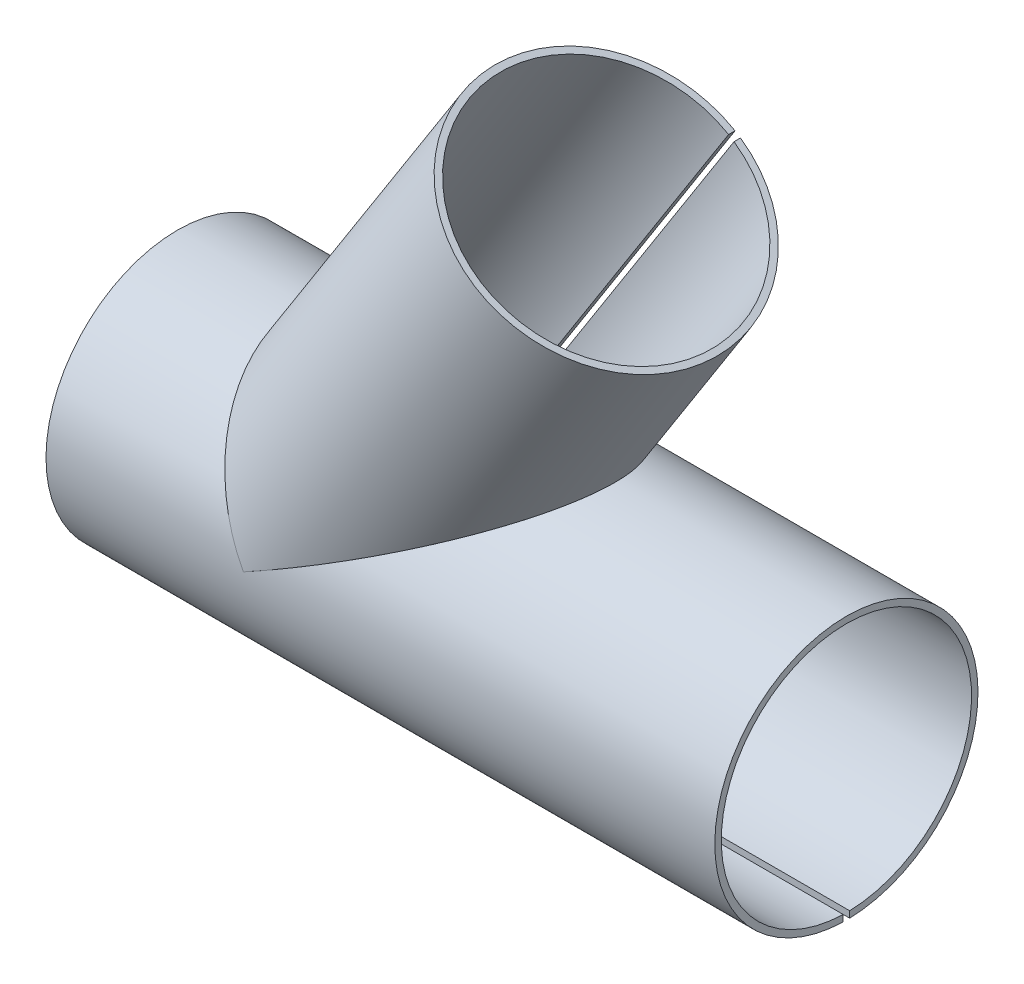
ISO-10303-21;
HEADER;
FILE_DESCRIPTION(('STEP AP214'),'2;1');
FILE_NAME('part.step','',(''),(''),'','','');
FILE_SCHEMA(('AUTOMOTIVE_DESIGN { 1 0 10303 214 1 1 1 1 }'));
ENDSEC;
DATA;
#1=APPLICATION_CONTEXT('core data for automotive mechanical design processes');
#2=APPLICATION_PROTOCOL_DEFINITION('international standard','automotive_design',2000,#1);
#3=PRODUCT_CONTEXT('',#1,'mechanical');
#4=PRODUCT('Part','Part','',(#3));
#5=PRODUCT_RELATED_PRODUCT_CATEGORY('part','',(#4));
#6=PRODUCT_DEFINITION_FORMATION('','',#4);
#7=PRODUCT_DEFINITION_CONTEXT('part definition',#1,'design');
#8=PRODUCT_DEFINITION('design','',#6,#7);
#9=PRODUCT_DEFINITION_SHAPE('','',#8);
#10=(LENGTH_UNIT() NAMED_UNIT(*) SI_UNIT(.MILLI.,.METRE.));
#11=(NAMED_UNIT(*) PLANE_ANGLE_UNIT() SI_UNIT($,.RADIAN.));
#12=(NAMED_UNIT(*) SI_UNIT($,.STERADIAN.) SOLID_ANGLE_UNIT());
#13=UNCERTAINTY_MEASURE_WITH_UNIT(LENGTH_MEASURE(1.E-05),#10,'distance_accuracy_value','');
#14=(GEOMETRIC_REPRESENTATION_CONTEXT(3) GLOBAL_UNCERTAINTY_ASSIGNED_CONTEXT((#13)) GLOBAL_UNIT_ASSIGNED_CONTEXT((#10,
#11,#12)) REPRESENTATION_CONTEXT('',''));
#15=CARTESIAN_POINT('',(0.,0.,0.));
#16=DIRECTION('',(0.,0.,1.));
#17=DIRECTION('',(1.,0.,0.));
#18=AXIS2_PLACEMENT_3D('',#15,#16,#17);
#19=CARTESIAN_POINT('',(0.,0.,0.));
#20=DIRECTION('',(0.537393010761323,0.843331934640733,0.));
#21=DIRECTION('',(-0.843331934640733,0.537393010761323,0.));
#22=AXIS2_PLACEMENT_3D('',#19,#20,#21);
#23=CYLINDRICAL_SURFACE('',#22,20.3683522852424);
#24=DIRECTION('',(0.537393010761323,0.843331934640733,0.));
#25=VECTOR('',#24,1.);
#26=CARTESIAN_POINT('',(0.421665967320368,-0.268696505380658,-20.362214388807));
#27=LINE('',#26,#25);
#28=CARTESIAN_POINT('',(36.2200673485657,55.9098069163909,-20.362214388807));
#29=VERTEX_POINT('',#28);
#30=CARTESIAN_POINT('',(0.911499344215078,0.499999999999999,-20.362214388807));
#31=VERTEX_POINT('',#30);
#32=EDGE_CURVE('E73',#29,#31,#27,.F.);
#33=ORIENTED_EDGE('',*,*,#32,.F.);
#34=CARTESIAN_POINT('',(35.7984013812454,56.1785034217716,0.));
#35=DIRECTION('',(0.537393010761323,0.843331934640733,0.));
#36=DIRECTION('',(-0.843331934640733,0.537393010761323,0.));
#37=AXIS2_PLACEMENT_3D('',#34,#35,#36);
#38=CIRCLE('',#37,20.3683522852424);
#39=CARTESIAN_POINT('',(35.376735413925,56.4471999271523,-20.362214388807));
#40=VERTEX_POINT('',#39);
#41=EDGE_CURVE('E117',#40,#29,#38,.T.);
#42=ORIENTED_EDGE('',*,*,#41,.F.);
#43=DIRECTION('',(0.537393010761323,0.843331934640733,0.));
#44=VECTOR('',#43,1.);
#45=CARTESIAN_POINT('',(-0.421665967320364,0.268696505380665,-20.362214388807));
#46=LINE('',#45,#44);
#47=CARTESIAN_POINT('',(-0.274273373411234,0.499999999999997,-20.362214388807));
#48=VERTEX_POINT('',#47);
#49=EDGE_CURVE('E103',#40,#48,#46,.F.);
#50=ORIENTED_EDGE('',*,*,#49,.T.);
#51=CARTESIAN_POINT('',(0.,0.,0.));
#52=DIRECTION('',(-0.876753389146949,-0.480940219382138,0.));
#53=DIRECTION('',(-0.480940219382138,0.876753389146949,0.));
#54=AXIS2_PLACEMENT_3D('',#51,#52,#53);
#55=ELLIPSE('',#54,23.2315637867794,20.3683522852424);
#56=CARTESIAN_POINT('',(0.,0.,20.3683522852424));
#57=VERTEX_POINT('',#56);
#58=EDGE_CURVE('E137',#48,#57,#55,.F.);
#59=ORIENTED_EDGE('',*,*,#58,.T.);
#60=CARTESIAN_POINT('',(0.,0.,0.));
#61=DIRECTION('',(0.480940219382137,-0.876753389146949,0.));
#62=DIRECTION('',(0.876753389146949,0.480940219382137,0.));
#63=AXIS2_PLACEMENT_3D('',#60,#61,#62);
#64=ELLIPSE('',#63,42.3511103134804,20.3683522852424);
#65=EDGE_CURVE('E127',#57,#31,#64,.F.);
#66=ORIENTED_EDGE('',*,*,#65,.T.);
#67=EDGE_LOOP('',(#33,#42,#50,#59,#66));
#68=FACE_BOUND('',#67,.T.);
#69=ADVANCED_FACE('F60',(#68),#23,.T.);
#70=CARTESIAN_POINT('',(-11.1729933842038,20.3683522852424,-20.3683522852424));
#71=DIRECTION('',(-0.876753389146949,-0.480940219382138,0.));
#72=DIRECTION('',(0.480940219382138,-0.876753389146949,0.));
#73=AXIS2_PLACEMENT_3D('',#70,#71,#72);
#74=PLANE('',#73);
#75=ORIENTED_EDGE('',*,*,#58,.F.);
#76=DIRECTION('',(0.,0.,1.));
#77=VECTOR('',#76,1.);
#78=CARTESIAN_POINT('',(-0.274273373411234,0.499999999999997,-20.3683522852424));
#79=LINE('',#78,#77);
#80=CARTESIAN_POINT('',(-0.274273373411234,0.499999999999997,-19.3618973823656));
#81=VERTEX_POINT('',#80);
#82=EDGE_CURVE('E67',#48,#81,#79,.T.);
#83=ORIENTED_EDGE('',*,*,#82,.T.);
#84=CARTESIAN_POINT('',(0.,0.,0.));
#85=DIRECTION('',(-0.876753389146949,-0.480940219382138,0.));
#86=DIRECTION('',(-0.480940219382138,0.876753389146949,0.));
#87=AXIS2_PLACEMENT_3D('',#84,#85,#86);
#88=ELLIPSE('',#87,22.0909922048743,19.3683522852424);
#89=CARTESIAN_POINT('',(0.,0.,19.3683522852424));
#90=VERTEX_POINT('',#89);
#91=EDGE_CURVE('E123',#81,#90,#88,.F.);
#92=ORIENTED_EDGE('',*,*,#91,.T.);
#93=DIRECTION('',(0.,0.,1.));
#94=VECTOR('',#93,1.);
#95=CARTESIAN_POINT('',(0.,0.,-20.3683522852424));
#96=LINE('',#95,#94);
#97=EDGE_CURVE('E145',#90,#57,#96,.T.);
#98=ORIENTED_EDGE('',*,*,#97,.T.);
#99=EDGE_LOOP('',(#75,#83,#92,#98));
#100=FACE_BOUND('',#99,.T.);
#101=ADVANCED_FACE('F134',(#100),#74,.T.);
#102=CARTESIAN_POINT('',(0.,0.,0.));
#103=DIRECTION('',(0.537393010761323,0.843331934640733,0.));
#104=DIRECTION('',(-0.843331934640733,0.537393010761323,0.));
#105=AXIS2_PLACEMENT_3D('',#102,#103,#104);
#106=CYLINDRICAL_SURFACE('',#105,19.3683522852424);
#107=CARTESIAN_POINT('',(35.7984013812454,56.1785034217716,0.));
#108=DIRECTION('',(0.537393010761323,0.843331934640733,0.));
#109=DIRECTION('',(-0.843331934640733,0.537393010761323,0.));
#110=AXIS2_PLACEMENT_3D('',#107,#108,#109);
#111=CIRCLE('',#110,19.3683522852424);
#112=CARTESIAN_POINT('',(35.376735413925,56.4471999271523,-19.3618973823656));
#113=VERTEX_POINT('',#112);
#114=CARTESIAN_POINT('',(36.2200673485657,55.9098069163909,-19.3618973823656));
#115=VERTEX_POINT('',#114);
#116=EDGE_CURVE('E119',#113,#115,#111,.T.);
#117=ORIENTED_EDGE('',*,*,#116,.T.);
#118=DIRECTION('',(0.537393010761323,0.843331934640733,0.));
#119=VECTOR('',#118,1.);
#120=CARTESIAN_POINT('',(0.421665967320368,-0.268696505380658,-19.3618973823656));
#121=LINE('',#120,#119);
#122=CARTESIAN_POINT('',(0.911499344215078,0.499999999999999,-19.3618973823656));
#123=VERTEX_POINT('',#122);
#124=EDGE_CURVE('E110',#115,#123,#121,.F.);
#125=ORIENTED_EDGE('',*,*,#124,.T.);
#126=CARTESIAN_POINT('',(0.,0.,0.));
#127=DIRECTION('',(0.480940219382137,-0.876753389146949,0.));
#128=DIRECTION('',(0.876753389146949,0.480940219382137,0.));
#129=AXIS2_PLACEMENT_3D('',#126,#127,#128);
#130=ELLIPSE('',#129,40.2718498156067,19.3683522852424);
#131=EDGE_CURVE('E125',#90,#123,#130,.F.);
#132=ORIENTED_EDGE('',*,*,#131,.F.);
#133=ORIENTED_EDGE('',*,*,#91,.F.);
#134=DIRECTION('',(0.537393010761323,0.843331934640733,0.));
#135=VECTOR('',#134,1.);
#136=CARTESIAN_POINT('',(-0.421665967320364,0.268696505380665,-19.3618973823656));
#137=LINE('',#136,#135);
#138=EDGE_CURVE('E81',#113,#81,#137,.F.);
#139=ORIENTED_EDGE('',*,*,#138,.F.);
#140=EDGE_LOOP('',(#117,#125,#132,#133,#139));
#141=FACE_BOUND('',#140,.T.);
#142=ADVANCED_FACE('F140',(#141),#106,.F.);
#143=CARTESIAN_POINT('',(35.7984013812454,56.1785034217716,0.));
#144=DIRECTION('',(0.537393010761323,0.843331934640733,0.));
#145=DIRECTION('',(-0.843331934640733,0.537393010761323,0.));
#146=AXIS2_PLACEMENT_3D('',#143,#144,#145);
#147=PLANE('',#146);
#148=DIRECTION('',(0.,0.,1.));
#149=VECTOR('',#148,1.);
#150=CARTESIAN_POINT('',(36.2200673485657,55.9098069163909,-20.3683522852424));
#151=LINE('',#150,#149);
#152=EDGE_CURVE('E120',#29,#115,#151,.T.);
#153=ORIENTED_EDGE('',*,*,#152,.T.);
#154=ORIENTED_EDGE('',*,*,#116,.F.);
#155=DIRECTION('',(0.,0.,1.));
#156=VECTOR('',#155,1.);
#157=CARTESIAN_POINT('',(35.376735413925,56.4471999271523,-20.3683522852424));
#158=LINE('',#157,#156);
#159=EDGE_CURVE('E106',#40,#113,#158,.T.);
#160=ORIENTED_EDGE('',*,*,#159,.F.);
#161=ORIENTED_EDGE('',*,*,#41,.T.);
#162=EDGE_LOOP('',(#153,#154,#160,#161));
#163=FACE_BOUND('',#162,.T.);
#164=ADVANCED_FACE('F116',(#163),#147,.T.);
#165=CARTESIAN_POINT('',(0.,0.,-20.3683522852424));
#166=DIRECTION('',(0.480940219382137,-0.876753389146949,0.));
#167=DIRECTION('',(0.876753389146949,0.480940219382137,0.));
#168=AXIS2_PLACEMENT_3D('',#165,#166,#167);
#169=PLANE('',#168);
#170=DIRECTION('',(0.,0.,1.));
#171=VECTOR('',#170,1.);
#172=CARTESIAN_POINT('',(0.911499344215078,0.499999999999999,-20.3683522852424));
#173=LINE('',#172,#171);
#174=EDGE_CURVE('E14',#31,#123,#173,.T.);
#175=ORIENTED_EDGE('',*,*,#174,.F.);
#176=ORIENTED_EDGE('',*,*,#65,.F.);
#177=ORIENTED_EDGE('',*,*,#97,.F.);
#178=ORIENTED_EDGE('',*,*,#131,.T.);
#179=EDGE_LOOP('',(#175,#176,#177,#178));
#180=FACE_BOUND('',#179,.T.);
#181=ADVANCED_FACE('F143',(#180),#169,.T.);
#182=CARTESIAN_POINT('',(-0.421665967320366,0.268696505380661,-20.3683522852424));
#183=DIRECTION('',(0.843331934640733,-0.537393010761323,0.));
#184=DIRECTION('',(0.537393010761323,0.843331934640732,0.));
#185=AXIS2_PLACEMENT_3D('',#182,#183,#184);
#186=PLANE('',#185);
#187=ORIENTED_EDGE('',*,*,#159,.T.);
#188=ORIENTED_EDGE('',*,*,#138,.T.);
#189=ORIENTED_EDGE('',*,*,#82,.F.);
#190=ORIENTED_EDGE('',*,*,#49,.F.);
#191=EDGE_LOOP('',(#187,#188,#189,#190));
#192=FACE_BOUND('',#191,.T.);
#193=ADVANCED_FACE('F105',(#192),#186,.T.);
#194=CARTESIAN_POINT('',(0.421665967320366,-0.268696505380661,-20.3683522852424));
#195=DIRECTION('',(0.843331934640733,-0.537393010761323,0.));
#196=DIRECTION('',(0.537393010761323,0.843331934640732,0.));
#197=AXIS2_PLACEMENT_3D('',#194,#195,#196);
#198=PLANE('',#197);
#199=ORIENTED_EDGE('',*,*,#32,.T.);
#200=ORIENTED_EDGE('',*,*,#174,.T.);
#201=ORIENTED_EDGE('',*,*,#124,.F.);
#202=ORIENTED_EDGE('',*,*,#152,.F.);
#203=EDGE_LOOP('',(#199,#200,#201,#202));
#204=FACE_BOUND('',#203,.T.);
#205=ADVANCED_FACE('F152',(#204),#198,.F.);
#206=CLOSED_SHELL('',(#69,#101,#142,#164,#181,#193,#205));
#207=MANIFOLD_SOLID_BREP('B2',#206);
#208=CARTESIAN_POINT('',(72.972061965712,0.,0.));
#209=DIRECTION('',(-1.,0.,0.));
#210=DIRECTION('',(0.,0.,1.));
#211=AXIS2_PLACEMENT_3D('',#208,#209,#210);
#212=CYLINDRICAL_SURFACE('',#211,20.3683522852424);
#213=CARTESIAN_POINT('',(0.,0.,0.));
#214=DIRECTION('',(-0.876753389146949,-0.480940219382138,0.));
#215=DIRECTION('',(-0.480940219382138,0.876753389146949,0.));
#216=AXIS2_PLACEMENT_3D('',#213,#214,#215);
#217=ELLIPSE('',#216,23.2315637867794,20.3683522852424);
#218=CARTESIAN_POINT('',(0.,0.,20.3683522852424));
#219=VERTEX_POINT('',#218);
#220=CARTESIAN_POINT('',(0.,0.,-20.3683522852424));
#221=VERTEX_POINT('',#220);
#222=EDGE_CURVE('E303',#219,#221,#217,.T.);
#223=ORIENTED_EDGE('',*,*,#222,.T.);
#224=CARTESIAN_POINT('',(0.,0.,0.));
#225=DIRECTION('',(0.480940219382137,-0.876753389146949,0.));
#226=DIRECTION('',(-0.876753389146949,-0.480940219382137,0.));
#227=AXIS2_PLACEMENT_3D('',#224,#225,#226);
#228=ELLIPSE('',#227,42.3511103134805,20.3683522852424);
#229=EDGE_CURVE('E309',#221,#219,#228,.T.);
#230=ORIENTED_EDGE('',*,*,#229,.T.);
#231=EDGE_LOOP('',(#223,#230));
#232=FACE_BOUND('',#231,.T.);
#233=CARTESIAN_POINT('',(-30.541636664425,0.,0.));
#234=DIRECTION('',(1.,0.,0.));
#235=DIRECTION('',(0.,0.,-1.));
#236=AXIS2_PLACEMENT_3D('',#233,#234,#235);
#237=CIRCLE('',#236,20.3683522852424);
#238=CARTESIAN_POINT('',(-30.541636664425,-20.362214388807,-0.5));
#239=VERTEX_POINT('',#238);
#240=CARTESIAN_POINT('',(-30.541636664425,-20.362214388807,0.5));
#241=VERTEX_POINT('',#240);
#242=EDGE_CURVE('E283',#239,#241,#237,.T.);
#243=ORIENTED_EDGE('',*,*,#242,.T.);
#244=DIRECTION('',(-1.,0.,0.));
#245=VECTOR('',#244,1.);
#246=CARTESIAN_POINT('',(72.972061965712,-20.362214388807,0.5));
#247=LINE('',#246,#245);
#248=CARTESIAN_POINT('',(72.972061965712,-20.362214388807,0.5));
#249=VERTEX_POINT('',#248);
#250=EDGE_CURVE('E224',#241,#249,#247,.F.);
#251=ORIENTED_EDGE('',*,*,#250,.T.);
#252=CARTESIAN_POINT('',(72.972061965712,0.,0.));
#253=DIRECTION('',(1.,0.,0.));
#254=DIRECTION('',(0.,0.,-1.));
#255=AXIS2_PLACEMENT_3D('',#252,#253,#254);
#256=CIRCLE('',#255,20.3683522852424);
#257=CARTESIAN_POINT('',(72.972061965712,-20.362214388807,-0.5));
#258=VERTEX_POINT('',#257);
#259=EDGE_CURVE('E274',#258,#249,#256,.T.);
#260=ORIENTED_EDGE('',*,*,#259,.F.);
#261=DIRECTION('',(-1.,0.,0.));
#262=VECTOR('',#261,1.);
#263=CARTESIAN_POINT('',(72.972061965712,-20.362214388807,-0.5));
#264=LINE('',#263,#262);
#265=EDGE_CURVE('E259',#239,#258,#264,.F.);
#266=ORIENTED_EDGE('',*,*,#265,.F.);
#267=EDGE_LOOP('',(#243,#251,#260,#266));
#268=FACE_BOUND('',#267,.T.);
#269=ADVANCED_FACE('F210',(#232,#268),#212,.T.);
#270=CARTESIAN_POINT('',(72.972061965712,0.,0.));
#271=DIRECTION('',(1.,0.,0.));
#272=DIRECTION('',(0.,0.,-1.));
#273=AXIS2_PLACEMENT_3D('',#270,#271,#272);
#274=PLANE('',#273);
#275=DIRECTION('',(0.,1.,0.));
#276=VECTOR('',#275,1.);
#277=CARTESIAN_POINT('',(72.972061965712,-20.3683522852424,0.5));
#278=LINE('',#277,#276);
#279=CARTESIAN_POINT('',(72.972061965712,-19.3618973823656,0.5));
#280=VERTEX_POINT('',#279);
#281=EDGE_CURVE('E277',#249,#280,#278,.T.);
#282=ORIENTED_EDGE('',*,*,#281,.T.);
#283=CARTESIAN_POINT('',(72.972061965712,0.,0.));
#284=DIRECTION('',(1.,0.,0.));
#285=DIRECTION('',(0.,0.,-1.));
#286=AXIS2_PLACEMENT_3D('',#283,#284,#285);
#287=CIRCLE('',#286,19.3683522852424);
#288=CARTESIAN_POINT('',(72.972061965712,-19.3618973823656,-0.5));
#289=VERTEX_POINT('',#288);
#290=EDGE_CURVE('E276',#289,#280,#287,.T.);
#291=ORIENTED_EDGE('',*,*,#290,.F.);
#292=DIRECTION('',(0.,1.,0.));
#293=VECTOR('',#292,1.);
#294=CARTESIAN_POINT('',(72.972061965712,-20.3683522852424,-0.5));
#295=LINE('',#294,#293);
#296=EDGE_CURVE('E262',#258,#289,#295,.T.);
#297=ORIENTED_EDGE('',*,*,#296,.F.);
#298=ORIENTED_EDGE('',*,*,#259,.T.);
#299=EDGE_LOOP('',(#282,#291,#297,#298));
#300=FACE_BOUND('',#299,.T.);
#301=ADVANCED_FACE('F273',(#300),#274,.T.);
#302=CARTESIAN_POINT('',(72.972061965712,0.,0.));
#303=DIRECTION('',(-1.,0.,0.));
#304=DIRECTION('',(0.,0.,1.));
#305=AXIS2_PLACEMENT_3D('',#302,#303,#304);
#306=CYLINDRICAL_SURFACE('',#305,19.3683522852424);
#307=DIRECTION('',(-1.,0.,0.));
#308=VECTOR('',#307,1.);
#309=CARTESIAN_POINT('',(72.972061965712,-19.3618973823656,0.5));
#310=LINE('',#309,#308);
#311=CARTESIAN_POINT('',(-30.541636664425,-19.3618973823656,0.5));
#312=VERTEX_POINT('',#311);
#313=EDGE_CURVE('E267',#312,#280,#310,.F.);
#314=ORIENTED_EDGE('',*,*,#313,.F.);
#315=CARTESIAN_POINT('',(-30.541636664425,0.,0.));
#316=DIRECTION('',(1.,0.,0.));
#317=DIRECTION('',(0.,0.,-1.));
#318=AXIS2_PLACEMENT_3D('',#315,#316,#317);
#319=CIRCLE('',#318,19.3683522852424);
#320=CARTESIAN_POINT('',(-30.541636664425,-19.3618973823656,-0.5));
#321=VERTEX_POINT('',#320);
#322=EDGE_CURVE('E311',#321,#312,#319,.T.);
#323=ORIENTED_EDGE('',*,*,#322,.F.);
#324=DIRECTION('',(-1.,0.,0.));
#325=VECTOR('',#324,1.);
#326=CARTESIAN_POINT('',(72.972061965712,-19.3618973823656,-0.5));
#327=LINE('',#326,#325);
#328=EDGE_CURVE('E231',#321,#289,#327,.F.);
#329=ORIENTED_EDGE('',*,*,#328,.T.);
#330=ORIENTED_EDGE('',*,*,#290,.T.);
#331=EDGE_LOOP('',(#314,#323,#329,#330));
#332=FACE_BOUND('',#331,.T.);
#333=CARTESIAN_POINT('',(0.,0.,0.));
#334=DIRECTION('',(0.480940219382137,-0.876753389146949,0.));
#335=DIRECTION('',(-0.876753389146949,-0.480940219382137,0.));
#336=AXIS2_PLACEMENT_3D('',#333,#334,#335);
#337=ELLIPSE('',#336,40.2718498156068,19.3683522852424);
#338=CARTESIAN_POINT('',(0.,0.,-19.3683522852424));
#339=VERTEX_POINT('',#338);
#340=CARTESIAN_POINT('',(0.,0.,19.3683522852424));
#341=VERTEX_POINT('',#340);
#342=EDGE_CURVE('E281',#339,#341,#337,.T.);
#343=ORIENTED_EDGE('',*,*,#342,.F.);
#344=CARTESIAN_POINT('',(0.,0.,0.));
#345=DIRECTION('',(-0.876753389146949,-0.480940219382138,0.));
#346=DIRECTION('',(-0.480940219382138,0.876753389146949,0.));
#347=AXIS2_PLACEMENT_3D('',#344,#345,#346);
#348=ELLIPSE('',#347,22.0909922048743,19.3683522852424);
#349=EDGE_CURVE('E279',#341,#339,#348,.T.);
#350=ORIENTED_EDGE('',*,*,#349,.F.);
#351=EDGE_LOOP('',(#343,#350));
#352=FACE_BOUND('',#351,.T.);
#353=ADVANCED_FACE('F299',(#332,#352),#306,.F.);
#354=CARTESIAN_POINT('',(-30.541636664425,0.,0.));
#355=DIRECTION('',(1.,0.,0.));
#356=DIRECTION('',(0.,0.,-1.));
#357=AXIS2_PLACEMENT_3D('',#354,#355,#356);
#358=PLANE('',#357);
#359=ORIENTED_EDGE('',*,*,#322,.T.);
#360=DIRECTION('',(0.,-1.,0.));
#361=VECTOR('',#360,1.);
#362=CARTESIAN_POINT('',(-30.541636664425,0.,0.5));
#363=LINE('',#362,#361);
#364=EDGE_CURVE('E58',#312,#241,#363,.T.);
#365=ORIENTED_EDGE('',*,*,#364,.T.);
#366=ORIENTED_EDGE('',*,*,#242,.F.);
#367=DIRECTION('',(0.,-1.,0.));
#368=VECTOR('',#367,1.);
#369=CARTESIAN_POINT('',(-30.541636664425,0.,-0.5));
#370=LINE('',#369,#368);
#371=EDGE_CURVE('E217',#321,#239,#370,.T.);
#372=ORIENTED_EDGE('',*,*,#371,.F.);
#373=EDGE_LOOP('',(#359,#365,#366,#372));
#374=FACE_BOUND('',#373,.T.);
#375=ADVANCED_FACE('F314',(#374),#358,.F.);
#376=CARTESIAN_POINT('',(0.,0.,-20.3683522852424));
#377=DIRECTION('',(0.480940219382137,-0.876753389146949,0.));
#378=DIRECTION('',(0.876753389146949,0.480940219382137,0.));
#379=AXIS2_PLACEMENT_3D('',#376,#377,#378);
#380=PLANE('',#379);
#381=DIRECTION('',(0.,0.,1.));
#382=VECTOR('',#381,1.);
#383=CARTESIAN_POINT('',(0.,0.,-20.3683522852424));
#384=LINE('',#383,#382);
#385=EDGE_CURVE('E297',#221,#339,#384,.T.);
#386=ORIENTED_EDGE('',*,*,#385,.T.);
#387=ORIENTED_EDGE('',*,*,#342,.T.);
#388=EDGE_CURVE('E295',#341,#219,#384,.T.);
#389=ORIENTED_EDGE('',*,*,#388,.T.);
#390=ORIENTED_EDGE('',*,*,#229,.F.);
#391=EDGE_LOOP('',(#386,#387,#389,#390));
#392=FACE_BOUND('',#391,.T.);
#393=ADVANCED_FACE('F293',(#392),#380,.F.);
#394=CARTESIAN_POINT('',(-11.1729933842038,20.3683522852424,-20.3683522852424));
#395=DIRECTION('',(-0.876753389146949,-0.480940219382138,0.));
#396=DIRECTION('',(0.480940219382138,-0.876753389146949,0.));
#397=AXIS2_PLACEMENT_3D('',#394,#395,#396);
#398=PLANE('',#397);
#399=ORIENTED_EDGE('',*,*,#222,.F.);
#400=ORIENTED_EDGE('',*,*,#388,.F.);
#401=ORIENTED_EDGE('',*,*,#349,.T.);
#402=ORIENTED_EDGE('',*,*,#385,.F.);
#403=EDGE_LOOP('',(#399,#400,#401,#402));
#404=FACE_BOUND('',#403,.T.);
#405=ADVANCED_FACE('F302',(#404),#398,.F.);
#406=CARTESIAN_POINT('',(-30.541636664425,-20.3683522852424,-0.5));
#407=DIRECTION('',(0.,0.,1.));
#408=DIRECTION('',(1.,0.,0.));
#409=AXIS2_PLACEMENT_3D('',#406,#407,#408);
#410=PLANE('',#409);
#411=ORIENTED_EDGE('',*,*,#265,.T.);
#412=ORIENTED_EDGE('',*,*,#296,.T.);
#413=ORIENTED_EDGE('',*,*,#328,.F.);
#414=ORIENTED_EDGE('',*,*,#371,.T.);
#415=EDGE_LOOP('',(#411,#412,#413,#414));
#416=FACE_BOUND('',#415,.T.);
#417=ADVANCED_FACE('F261',(#416),#410,.T.);
#418=CARTESIAN_POINT('',(-30.541636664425,-20.3683522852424,0.5));
#419=DIRECTION('',(0.,0.,1.));
#420=DIRECTION('',(1.,0.,0.));
#421=AXIS2_PLACEMENT_3D('',#418,#419,#420);
#422=PLANE('',#421);
#423=ORIENTED_EDGE('',*,*,#364,.F.);
#424=ORIENTED_EDGE('',*,*,#313,.T.);
#425=ORIENTED_EDGE('',*,*,#281,.F.);
#426=ORIENTED_EDGE('',*,*,#250,.F.);
#427=EDGE_LOOP('',(#423,#424,#425,#426));
#428=FACE_BOUND('',#427,.T.);
#429=ADVANCED_FACE('F317',(#428),#422,.F.);
#430=CLOSED_SHELL('',(#269,#301,#353,#375,#393,#405,#417,#429));
#431=MANIFOLD_SOLID_BREP('B8',#430);
#432=ADVANCED_BREP_SHAPE_REPRESENTATION('',(#18,#207,#431),#14);
#433=SHAPE_DEFINITION_REPRESENTATION(#9,#432);
ENDSEC;
END-ISO-10303-21;
